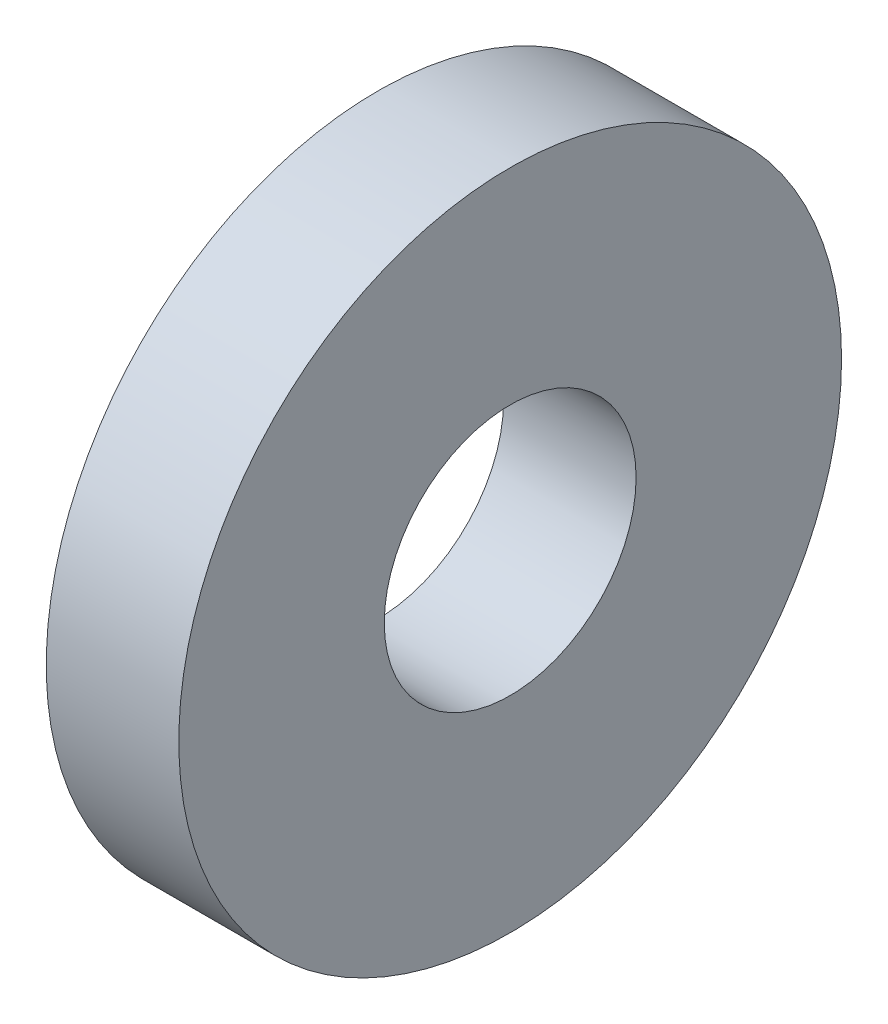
ISO-10303-21;
HEADER;
FILE_DESCRIPTION(('STEP AP214'),'2;1');
FILE_NAME('part.step','',(''),(''),'','','');
FILE_SCHEMA(('AUTOMOTIVE_DESIGN { 1 0 10303 214 1 1 1 1 }'));
ENDSEC;
DATA;
#1=APPLICATION_CONTEXT('core data for automotive mechanical design processes');
#2=APPLICATION_PROTOCOL_DEFINITION('international standard','automotive_design',2000,#1);
#3=PRODUCT_CONTEXT('',#1,'mechanical');
#4=PRODUCT('Part','Part','',(#3));
#5=PRODUCT_RELATED_PRODUCT_CATEGORY('part','',(#4));
#6=PRODUCT_DEFINITION_FORMATION('','',#4);
#7=PRODUCT_DEFINITION_CONTEXT('part definition',#1,'design');
#8=PRODUCT_DEFINITION('design','',#6,#7);
#9=PRODUCT_DEFINITION_SHAPE('','',#8);
#10=(LENGTH_UNIT() NAMED_UNIT(*) SI_UNIT(.MILLI.,.METRE.));
#11=(NAMED_UNIT(*) PLANE_ANGLE_UNIT() SI_UNIT($,.RADIAN.));
#12=(NAMED_UNIT(*) SI_UNIT($,.STERADIAN.) SOLID_ANGLE_UNIT());
#13=UNCERTAINTY_MEASURE_WITH_UNIT(LENGTH_MEASURE(1.E-05),#10,'distance_accuracy_value','');
#14=(GEOMETRIC_REPRESENTATION_CONTEXT(3) GLOBAL_UNCERTAINTY_ASSIGNED_CONTEXT((#13)) GLOBAL_UNIT_ASSIGNED_CONTEXT((#10,
#11,#12)) REPRESENTATION_CONTEXT('',''));
#15=CARTESIAN_POINT('',(0.,0.,0.));
#16=DIRECTION('',(0.,0.,1.));
#17=DIRECTION('',(1.,0.,0.));
#18=AXIS2_PLACEMENT_3D('',#15,#16,#17);
#19=CARTESIAN_POINT('',(1.,0.,0.));
#20=DIRECTION('',(1.,0.,0.));
#21=DIRECTION('',(0.,0.,-1.));
#22=AXIS2_PLACEMENT_3D('',#19,#20,#21);
#23=PLANE('',#22);
#24=CARTESIAN_POINT('',(1.,0.,0.));
#25=DIRECTION('',(1.,0.,0.));
#26=DIRECTION('',(0.,0.,-1.));
#27=AXIS2_PLACEMENT_3D('',#24,#25,#26);
#28=CIRCLE('',#27,2.5);
#29=CARTESIAN_POINT('',(1.,0.,-2.5));
#30=VERTEX_POINT('',#29);
#31=EDGE_CURVE('E10',#30,#30,#28,.T.);
#32=ORIENTED_EDGE('',*,*,#31,.T.);
#33=EDGE_LOOP('',(#32));
#34=FACE_BOUND('',#33,.T.);
#35=CARTESIAN_POINT('',(1.,0.,0.));
#36=DIRECTION('',(1.,0.,0.));
#37=DIRECTION('',(0.,0.,-1.));
#38=AXIS2_PLACEMENT_3D('',#35,#36,#37);
#39=CIRCLE('',#38,0.95);
#40=CARTESIAN_POINT('',(1.,0.,-0.95));
#41=VERTEX_POINT('',#40);
#42=EDGE_CURVE('E43',#41,#41,#39,.T.);
#43=ORIENTED_EDGE('',*,*,#42,.F.);
#44=EDGE_LOOP('',(#43));
#45=FACE_BOUND('',#44,.T.);
#46=ADVANCED_FACE('F32',(#34,#45),#23,.T.);
#47=CARTESIAN_POINT('',(0.,0.,0.));
#48=DIRECTION('',(1.,0.,0.));
#49=DIRECTION('',(0.,0.,-1.));
#50=AXIS2_PLACEMENT_3D('',#47,#48,#49);
#51=PLANE('',#50);
#52=CARTESIAN_POINT('',(0.,0.,0.));
#53=DIRECTION('',(1.,0.,0.));
#54=DIRECTION('',(0.,0.,-1.));
#55=AXIS2_PLACEMENT_3D('',#52,#53,#54);
#56=CIRCLE('',#55,2.5);
#57=CARTESIAN_POINT('',(0.,0.,-2.5));
#58=VERTEX_POINT('',#57);
#59=EDGE_CURVE('E36',#58,#58,#56,.T.);
#60=ORIENTED_EDGE('',*,*,#59,.F.);
#61=EDGE_LOOP('',(#60));
#62=FACE_BOUND('',#61,.T.);
#63=CARTESIAN_POINT('',(0.,0.,0.));
#64=DIRECTION('',(1.,0.,0.));
#65=DIRECTION('',(0.,0.,-1.));
#66=AXIS2_PLACEMENT_3D('',#63,#64,#65);
#67=CIRCLE('',#66,0.95);
#68=CARTESIAN_POINT('',(0.,0.,-0.95));
#69=VERTEX_POINT('',#68);
#70=EDGE_CURVE('E45',#69,#69,#67,.T.);
#71=ORIENTED_EDGE('',*,*,#70,.T.);
#72=EDGE_LOOP('',(#71));
#73=FACE_BOUND('',#72,.T.);
#74=ADVANCED_FACE('F55',(#62,#73),#51,.F.);
#75=CARTESIAN_POINT('',(1.,0.,0.));
#76=DIRECTION('',(-1.,0.,0.));
#77=DIRECTION('',(0.,0.,1.));
#78=AXIS2_PLACEMENT_3D('',#75,#76,#77);
#79=CYLINDRICAL_SURFACE('',#78,2.5);
#80=ORIENTED_EDGE('',*,*,#31,.F.);
#81=EDGE_LOOP('',(#80));
#82=FACE_BOUND('',#81,.T.);
#83=ORIENTED_EDGE('',*,*,#59,.T.);
#84=EDGE_LOOP('',(#83));
#85=FACE_BOUND('',#84,.T.);
#86=ADVANCED_FACE('F34',(#82,#85),#79,.T.);
#87=CARTESIAN_POINT('',(1.,0.,0.));
#88=DIRECTION('',(-1.,0.,0.));
#89=DIRECTION('',(0.,0.,1.));
#90=AXIS2_PLACEMENT_3D('',#87,#88,#89);
#91=CYLINDRICAL_SURFACE('',#90,0.95);
#92=ORIENTED_EDGE('',*,*,#42,.T.);
#93=EDGE_LOOP('',(#92));
#94=FACE_BOUND('',#93,.T.);
#95=ORIENTED_EDGE('',*,*,#70,.F.);
#96=EDGE_LOOP('',(#95));
#97=FACE_BOUND('',#96,.T.);
#98=ADVANCED_FACE('F51',(#94,#97),#91,.F.);
#99=CLOSED_SHELL('',(#46,#74,#86,#98));
#100=MANIFOLD_SOLID_BREP('B2',#99);
#101=ADVANCED_BREP_SHAPE_REPRESENTATION('',(#18,#100),#14);
#102=SHAPE_DEFINITION_REPRESENTATION(#9,#101);
ENDSEC;
END-ISO-10303-21;
